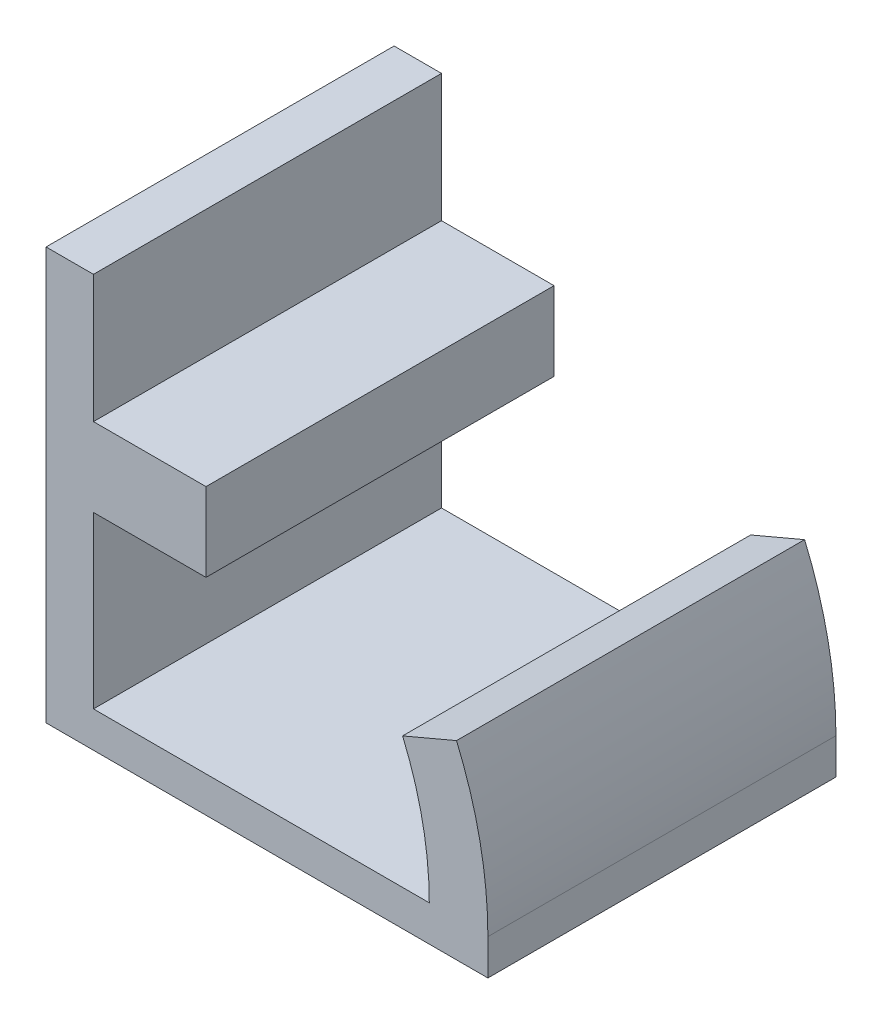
from build123d import *

# Parameters (mm, degrees)
BOSS_EXTRUDE1_DEPTH = 66.5
SKETCH3_W           = 133
SKETCH3_H           = 30.043079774
BOSS_EXTRUDE2_DEPTH = 43
SKETCH2_W           = 22.391547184
SKETCH2_H           = 133
REVOLVE2_ANGLE      = 23


with BuildPart() as part:
    # Sketch1 → Boss-Extrude1 (new, symmetric)
    with BuildSketch(Plane.XY):
        Polygon((0, 157.514311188), (0, 0), (168.839701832, 0), (168.839701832, 13.684496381), (18.117502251, 13.684496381), (18.117502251, 157.514311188), align=None)
    extrude(amount=BOSS_EXTRUDE1_DEPTH, both=True)

    # Sketch3 → Boss-Extrude2 (add)
    with BuildSketch(Plane(origin=(18.117502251, 0, 0), x_dir=(0, 0, -1), z_dir=(1, 0, 0))):
        with Locations((0, 93.740407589)):
            Rectangle(SKETCH3_W, SKETCH3_H)
    extrude(amount=BOSS_EXTRUDE2_DEPTH)

    # Sketch2 → Revolve2 (revolve)
    with BuildSketch(Plane(origin=(0, 13.684496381, 0), x_dir=(-1, 0, 0), z_dir=(0, 1, 0))):
        with Locations((-157.64392824, 0)):
            Rectangle(SKETCH2_W, SKETCH2_H)
    revolve(axis=Axis((18.117502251, 13.684496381, 66.5), (0, 0, 1)), revolution_arc=REVOLVE2_ANGLE)


solid = part.part
